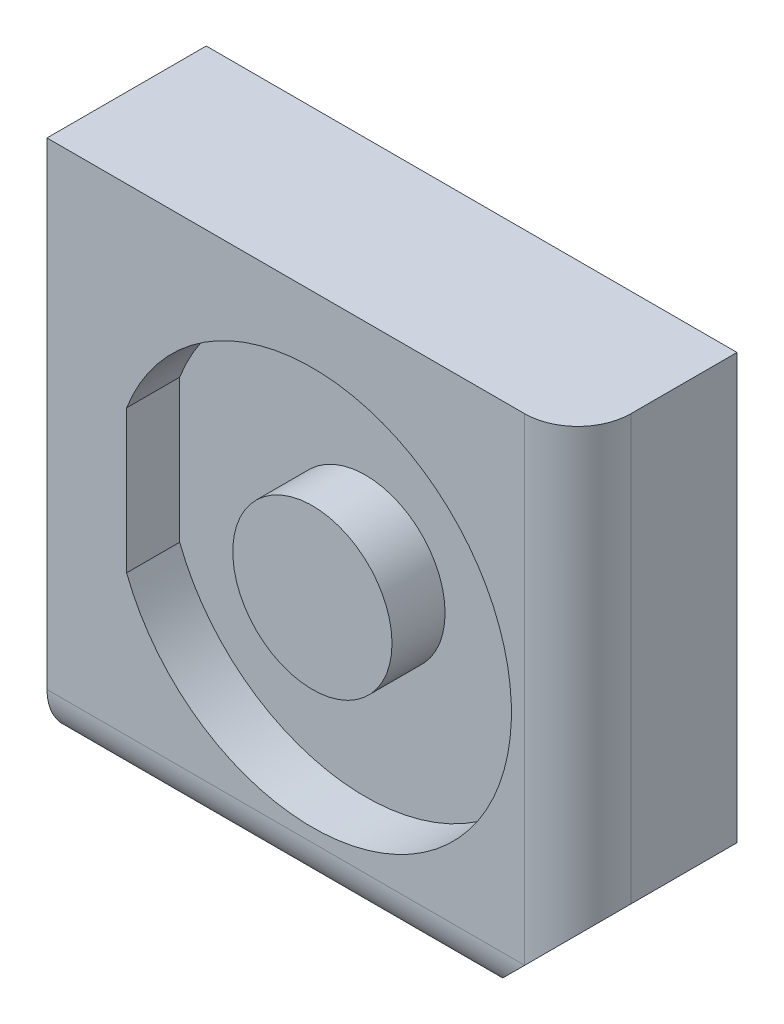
ISO-10303-21;
HEADER;
FILE_DESCRIPTION(('STEP AP214'),'2;1');
FILE_NAME('part.step','',(''),(''),'','','');
FILE_SCHEMA(('AUTOMOTIVE_DESIGN { 1 0 10303 214 1 1 1 1 }'));
ENDSEC;
DATA;
#1=APPLICATION_CONTEXT('core data for automotive mechanical design processes');
#2=APPLICATION_PROTOCOL_DEFINITION('international standard','automotive_design',2000,#1);
#3=PRODUCT_CONTEXT('',#1,'mechanical');
#4=PRODUCT('Part','Part','',(#3));
#5=PRODUCT_RELATED_PRODUCT_CATEGORY('part','',(#4));
#6=PRODUCT_DEFINITION_FORMATION('','',#4);
#7=PRODUCT_DEFINITION_CONTEXT('part definition',#1,'design');
#8=PRODUCT_DEFINITION('design','',#6,#7);
#9=PRODUCT_DEFINITION_SHAPE('','',#8);
#10=(LENGTH_UNIT() NAMED_UNIT(*) SI_UNIT(.MILLI.,.METRE.));
#11=(NAMED_UNIT(*) PLANE_ANGLE_UNIT() SI_UNIT($,.RADIAN.));
#12=(NAMED_UNIT(*) SI_UNIT($,.STERADIAN.) SOLID_ANGLE_UNIT());
#13=UNCERTAINTY_MEASURE_WITH_UNIT(LENGTH_MEASURE(1.E-05),#10,'distance_accuracy_value','');
#14=(GEOMETRIC_REPRESENTATION_CONTEXT(3) GLOBAL_UNCERTAINTY_ASSIGNED_CONTEXT((#13)) GLOBAL_UNIT_ASSIGNED_CONTEXT((#10,
#11,#12)) REPRESENTATION_CONTEXT('',''));
#15=CARTESIAN_POINT('',(0.,0.,0.));
#16=DIRECTION('',(0.,0.,1.));
#17=DIRECTION('',(1.,0.,0.));
#18=AXIS2_PLACEMENT_3D('',#15,#16,#17);
#19=CARTESIAN_POINT('',(-50.,50.,30.));
#20=DIRECTION('',(1.,0.,0.));
#21=DIRECTION('',(0.,1.,0.));
#22=AXIS2_PLACEMENT_3D('',#19,#20,#21);
#23=PLANE('',#22);
#24=DIRECTION('',(0.,0.,-1.));
#25=VECTOR('',#24,1.);
#26=CARTESIAN_POINT('',(-50.,-50.,30.));
#27=LINE('',#26,#25);
#28=CARTESIAN_POINT('',(-50.,-50.,20.));
#29=VERTEX_POINT('',#28);
#30=CARTESIAN_POINT('',(-50.,-50.,0.));
#31=VERTEX_POINT('',#30);
#32=EDGE_CURVE('E146',#29,#31,#27,.T.);
#33=ORIENTED_EDGE('',*,*,#32,.F.);
#34=CARTESIAN_POINT('',(-50.,-40.,20.));
#35=DIRECTION('',(1.,0.,0.));
#36=DIRECTION('',(0.,1.,0.));
#37=AXIS2_PLACEMENT_3D('',#34,#35,#36);
#38=CIRCLE('',#37,10.);
#39=CARTESIAN_POINT('',(-50.,-40.,30.));
#40=VERTEX_POINT('',#39);
#41=EDGE_CURVE('E155',#29,#40,#38,.F.);
#42=ORIENTED_EDGE('',*,*,#41,.T.);
#43=DIRECTION('',(0.,-1.,0.));
#44=VECTOR('',#43,1.);
#45=CARTESIAN_POINT('',(-50.,50.,30.));
#46=LINE('',#45,#44);
#47=CARTESIAN_POINT('',(-50.,50.,30.));
#48=VERTEX_POINT('',#47);
#49=EDGE_CURVE('E127',#48,#40,#46,.T.);
#50=ORIENTED_EDGE('',*,*,#49,.F.);
#51=DIRECTION('',(0.,0.,-1.));
#52=VECTOR('',#51,1.);
#53=CARTESIAN_POINT('',(-50.,50.,30.));
#54=LINE('',#53,#52);
#55=CARTESIAN_POINT('',(-50.,50.,0.));
#56=VERTEX_POINT('',#55);
#57=EDGE_CURVE('E133',#48,#56,#54,.T.);
#58=ORIENTED_EDGE('',*,*,#57,.T.);
#59=DIRECTION('',(0.,-1.,0.));
#60=VECTOR('',#59,1.);
#61=CARTESIAN_POINT('',(-50.,50.,0.));
#62=LINE('',#61,#60);
#63=EDGE_CURVE('E125',#56,#31,#62,.T.);
#64=ORIENTED_EDGE('',*,*,#63,.T.);
#65=EDGE_LOOP('',(#33,#42,#50,#58,#64));
#66=FACE_BOUND('',#65,.T.);
#67=ADVANCED_FACE('F32',(#66),#23,.F.);
#68=CARTESIAN_POINT('',(-50.,-50.,30.));
#69=DIRECTION('',(0.,1.,0.));
#70=DIRECTION('',(0.,0.,1.));
#71=AXIS2_PLACEMENT_3D('',#68,#69,#70);
#72=PLANE('',#71);
#73=DIRECTION('',(1.,0.,0.));
#74=VECTOR('',#73,1.);
#75=CARTESIAN_POINT('',(-50.,-50.,0.));
#76=LINE('',#75,#74);
#77=CARTESIAN_POINT('',(30.,-50.,0.));
#78=VERTEX_POINT('',#77);
#79=EDGE_CURVE('E136',#31,#78,#76,.T.);
#80=ORIENTED_EDGE('',*,*,#79,.T.);
#81=DIRECTION('',(0.,0.,1.));
#82=VECTOR('',#81,1.);
#83=CARTESIAN_POINT('',(30.,-50.,30.));
#84=LINE('',#83,#82);
#85=CARTESIAN_POINT('',(30.,-50.,20.));
#86=VERTEX_POINT('',#85);
#87=EDGE_CURVE('E47',#78,#86,#84,.T.);
#88=ORIENTED_EDGE('',*,*,#87,.T.);
#89=DIRECTION('',(1.,0.,0.));
#90=VECTOR('',#89,1.);
#91=CARTESIAN_POINT('',(-50.,-50.,20.));
#92=LINE('',#91,#90);
#93=EDGE_CURVE('E153',#86,#29,#92,.F.);
#94=ORIENTED_EDGE('',*,*,#93,.T.);
#95=ORIENTED_EDGE('',*,*,#32,.T.);
#96=EDGE_LOOP('',(#80,#88,#94,#95));
#97=FACE_BOUND('',#96,.T.);
#98=ADVANCED_FACE('F194',(#97),#72,.F.);
#99=CARTESIAN_POINT('',(50.,50.,30.));
#100=DIRECTION('',(-1.,0.,0.));
#101=DIRECTION('',(0.,-1.,0.));
#102=AXIS2_PLACEMENT_3D('',#99,#100,#101);
#103=PLANE('',#102);
#104=DIRECTION('',(0.,1.,0.));
#105=VECTOR('',#104,1.);
#106=CARTESIAN_POINT('',(50.,-50.,20.));
#107=LINE('',#106,#105);
#108=CARTESIAN_POINT('',(50.,50.,20.));
#109=VERTEX_POINT('',#108);
#110=CARTESIAN_POINT('',(50.,-30.,20.));
#111=VERTEX_POINT('',#110);
#112=EDGE_CURVE('E159',#109,#111,#107,.F.);
#113=ORIENTED_EDGE('',*,*,#112,.T.);
#114=DIRECTION('',(0.,0.,-1.));
#115=VECTOR('',#114,1.);
#116=CARTESIAN_POINT('',(50.,-30.,30.));
#117=LINE('',#116,#115);
#118=CARTESIAN_POINT('',(50.,-30.,0.));
#119=VERTEX_POINT('',#118);
#120=EDGE_CURVE('E162',#111,#119,#117,.T.);
#121=ORIENTED_EDGE('',*,*,#120,.T.);
#122=DIRECTION('',(0.,1.,0.));
#123=VECTOR('',#122,1.);
#124=CARTESIAN_POINT('',(50.,50.,0.));
#125=LINE('',#124,#123);
#126=CARTESIAN_POINT('',(50.,50.,0.));
#127=VERTEX_POINT('',#126);
#128=EDGE_CURVE('E138',#119,#127,#125,.T.);
#129=ORIENTED_EDGE('',*,*,#128,.T.);
#130=DIRECTION('',(0.,0.,-1.));
#131=VECTOR('',#130,1.);
#132=CARTESIAN_POINT('',(50.,50.,30.));
#133=LINE('',#132,#131);
#134=EDGE_CURVE('E143',#109,#127,#133,.T.);
#135=ORIENTED_EDGE('',*,*,#134,.F.);
#136=EDGE_LOOP('',(#113,#121,#129,#135));
#137=FACE_BOUND('',#136,.T.);
#138=ADVANCED_FACE('F184',(#137),#103,.F.);
#139=CARTESIAN_POINT('',(-50.,50.,30.));
#140=DIRECTION('',(0.,-1.,0.));
#141=DIRECTION('',(0.,0.,-1.));
#142=AXIS2_PLACEMENT_3D('',#139,#140,#141);
#143=PLANE('',#142);
#144=DIRECTION('',(-1.,0.,0.));
#145=VECTOR('',#144,1.);
#146=CARTESIAN_POINT('',(-50.,50.,30.));
#147=LINE('',#146,#145);
#148=CARTESIAN_POINT('',(40.,50.,30.));
#149=VERTEX_POINT('',#148);
#150=EDGE_CURVE('E130',#149,#48,#147,.T.);
#151=ORIENTED_EDGE('',*,*,#150,.F.);
#152=CARTESIAN_POINT('',(40.,50.,20.));
#153=DIRECTION('',(0.,-1.,0.));
#154=DIRECTION('',(0.,0.,-1.));
#155=AXIS2_PLACEMENT_3D('',#152,#153,#154);
#156=CIRCLE('',#155,10.);
#157=EDGE_CURVE('E157',#149,#109,#156,.F.);
#158=ORIENTED_EDGE('',*,*,#157,.T.);
#159=ORIENTED_EDGE('',*,*,#134,.T.);
#160=DIRECTION('',(-1.,0.,0.));
#161=VECTOR('',#160,1.);
#162=CARTESIAN_POINT('',(-50.,50.,0.));
#163=LINE('',#162,#161);
#164=EDGE_CURVE('E131',#127,#56,#163,.T.);
#165=ORIENTED_EDGE('',*,*,#164,.T.);
#166=ORIENTED_EDGE('',*,*,#57,.F.);
#167=EDGE_LOOP('',(#151,#158,#159,#165,#166));
#168=FACE_BOUND('',#167,.T.);
#169=ADVANCED_FACE('F191',(#168),#143,.F.);
#170=CARTESIAN_POINT('',(0.,0.,30.));
#171=DIRECTION('',(0.,0.,1.));
#172=DIRECTION('',(1.,0.,0.));
#173=AXIS2_PLACEMENT_3D('',#170,#171,#172);
#174=PLANE('',#173);
#175=CARTESIAN_POINT('',(0.,0.,30.));
#176=DIRECTION('',(0.,0.,1.));
#177=DIRECTION('',(1.,0.,0.));
#178=AXIS2_PLACEMENT_3D('',#175,#176,#177);
#179=CIRCLE('',#178,37.5);
#180=CARTESIAN_POINT('',(-35.,-13.4629120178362,30.));
#181=VERTEX_POINT('',#180);
#182=CARTESIAN_POINT('',(-35.,13.4629120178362,30.));
#183=VERTEX_POINT('',#182);
#184=EDGE_CURVE('E106',#181,#183,#179,.T.);
#185=ORIENTED_EDGE('',*,*,#184,.F.);
#186=DIRECTION('',(0.,-1.,0.));
#187=VECTOR('',#186,1.);
#188=CARTESIAN_POINT('',(-35.,13.4629120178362,30.));
#189=LINE('',#188,#187);
#190=EDGE_CURVE('E116',#183,#181,#189,.T.);
#191=ORIENTED_EDGE('',*,*,#190,.F.);
#192=EDGE_LOOP('',(#185,#191));
#193=FACE_BOUND('',#192,.T.);
#194=ORIENTED_EDGE('',*,*,#49,.T.);
#195=DIRECTION('',(1.,0.,0.));
#196=VECTOR('',#195,1.);
#197=CARTESIAN_POINT('',(50.,-40.,30.));
#198=LINE('',#197,#196);
#199=CARTESIAN_POINT('',(40.,-40.,30.));
#200=VERTEX_POINT('',#199);
#201=EDGE_CURVE('E150',#40,#200,#198,.T.);
#202=ORIENTED_EDGE('',*,*,#201,.T.);
#203=DIRECTION('',(0.,1.,0.));
#204=VECTOR('',#203,1.);
#205=CARTESIAN_POINT('',(40.,50.,30.));
#206=LINE('',#205,#204);
#207=EDGE_CURVE('E148',#200,#149,#206,.T.);
#208=ORIENTED_EDGE('',*,*,#207,.T.);
#209=ORIENTED_EDGE('',*,*,#150,.T.);
#210=EDGE_LOOP('',(#194,#202,#208,#209));
#211=FACE_BOUND('',#210,.T.);
#212=ADVANCED_FACE('F180',(#193,#211),#174,.T.);
#213=CARTESIAN_POINT('',(0.,0.,0.));
#214=DIRECTION('',(0.,0.,1.));
#215=DIRECTION('',(1.,0.,0.));
#216=AXIS2_PLACEMENT_3D('',#213,#214,#215);
#217=PLANE('',#216);
#218=ORIENTED_EDGE('',*,*,#128,.F.);
#219=DIRECTION('',(0.707106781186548,0.707106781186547,0.));
#220=VECTOR('',#219,1.);
#221=CARTESIAN_POINT('',(50.,-30.,0.));
#222=LINE('',#221,#220);
#223=EDGE_CURVE('E55',#119,#78,#222,.F.);
#224=ORIENTED_EDGE('',*,*,#223,.T.);
#225=ORIENTED_EDGE('',*,*,#79,.F.);
#226=ORIENTED_EDGE('',*,*,#63,.F.);
#227=ORIENTED_EDGE('',*,*,#164,.F.);
#228=EDGE_LOOP('',(#218,#224,#225,#226,#227));
#229=FACE_BOUND('',#228,.T.);
#230=ADVANCED_FACE('F187',(#229),#217,.F.);
#231=CARTESIAN_POINT('',(0.,0.,20.));
#232=DIRECTION('',(0.,0.,1.));
#233=DIRECTION('',(1.,0.,0.));
#234=AXIS2_PLACEMENT_3D('',#231,#232,#233);
#235=CYLINDRICAL_SURFACE('',#234,37.5);
#236=ORIENTED_EDGE('',*,*,#184,.T.);
#237=DIRECTION('',(0.,0.,1.));
#238=VECTOR('',#237,1.);
#239=CARTESIAN_POINT('',(-35.,13.4629120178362,20.));
#240=LINE('',#239,#238);
#241=CARTESIAN_POINT('',(-35.,13.4629120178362,20.));
#242=VERTEX_POINT('',#241);
#243=EDGE_CURVE('E100',#242,#183,#240,.T.);
#244=ORIENTED_EDGE('',*,*,#243,.F.);
#245=CARTESIAN_POINT('',(0.,0.,20.));
#246=DIRECTION('',(0.,0.,1.));
#247=DIRECTION('',(1.,0.,0.));
#248=AXIS2_PLACEMENT_3D('',#245,#246,#247);
#249=CIRCLE('',#248,37.5);
#250=CARTESIAN_POINT('',(-35.,-13.4629120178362,20.));
#251=VERTEX_POINT('',#250);
#252=EDGE_CURVE('E103',#251,#242,#249,.T.);
#253=ORIENTED_EDGE('',*,*,#252,.F.);
#254=DIRECTION('',(0.,0.,1.));
#255=VECTOR('',#254,1.);
#256=CARTESIAN_POINT('',(-35.,-13.4629120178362,20.));
#257=LINE('',#256,#255);
#258=EDGE_CURVE('E111',#251,#181,#257,.T.);
#259=ORIENTED_EDGE('',*,*,#258,.T.);
#260=EDGE_LOOP('',(#236,#244,#253,#259));
#261=FACE_BOUND('',#260,.T.);
#262=ADVANCED_FACE('F102',(#261),#235,.F.);
#263=CARTESIAN_POINT('',(-35.,13.4629120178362,20.));
#264=DIRECTION('',(-1.,0.,0.));
#265=DIRECTION('',(0.,0.,1.));
#266=AXIS2_PLACEMENT_3D('',#263,#264,#265);
#267=PLANE('',#266);
#268=ORIENTED_EDGE('',*,*,#190,.T.);
#269=ORIENTED_EDGE('',*,*,#258,.F.);
#270=DIRECTION('',(0.,-1.,0.));
#271=VECTOR('',#270,1.);
#272=CARTESIAN_POINT('',(-35.,13.4629120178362,20.));
#273=LINE('',#272,#271);
#274=EDGE_CURVE('E112',#242,#251,#273,.T.);
#275=ORIENTED_EDGE('',*,*,#274,.F.);
#276=ORIENTED_EDGE('',*,*,#243,.T.);
#277=EDGE_LOOP('',(#268,#269,#275,#276));
#278=FACE_BOUND('',#277,.T.);
#279=ADVANCED_FACE('F118',(#278),#267,.F.);
#280=CARTESIAN_POINT('',(0.,0.,20.));
#281=DIRECTION('',(0.,0.,1.));
#282=DIRECTION('',(1.,0.,0.));
#283=AXIS2_PLACEMENT_3D('',#280,#281,#282);
#284=PLANE('',#283);
#285=CARTESIAN_POINT('',(0.,0.,20.));
#286=DIRECTION('',(0.,0.,1.));
#287=DIRECTION('',(1.,0.,0.));
#288=AXIS2_PLACEMENT_3D('',#285,#286,#287);
#289=CIRCLE('',#288,15.);
#290=CARTESIAN_POINT('',(15.,0.,20.));
#291=VERTEX_POINT('',#290);
#292=EDGE_CURVE('E123',#291,#291,#289,.T.);
#293=ORIENTED_EDGE('',*,*,#292,.F.);
#294=EDGE_LOOP('',(#293));
#295=FACE_BOUND('',#294,.T.);
#296=ORIENTED_EDGE('',*,*,#252,.T.);
#297=ORIENTED_EDGE('',*,*,#274,.T.);
#298=EDGE_LOOP('',(#296,#297));
#299=FACE_BOUND('',#298,.T.);
#300=ADVANCED_FACE('F115',(#295,#299),#284,.T.);
#301=CARTESIAN_POINT('',(0.,0.,20.));
#302=DIRECTION('',(0.,0.,1.));
#303=DIRECTION('',(1.,0.,0.));
#304=AXIS2_PLACEMENT_3D('',#301,#302,#303);
#305=CYLINDRICAL_SURFACE('',#304,15.);
#306=ORIENTED_EDGE('',*,*,#292,.T.);
#307=EDGE_LOOP('',(#306));
#308=FACE_BOUND('',#307,.T.);
#309=CARTESIAN_POINT('',(0.,0.,30.));
#310=DIRECTION('',(0.,0.,1.));
#311=DIRECTION('',(1.,0.,0.));
#312=AXIS2_PLACEMENT_3D('',#309,#310,#311);
#313=CIRCLE('',#312,15.);
#314=CARTESIAN_POINT('',(15.,0.,30.));
#315=VERTEX_POINT('',#314);
#316=EDGE_CURVE('E313',#315,#315,#313,.T.);
#317=ORIENTED_EDGE('',*,*,#316,.F.);
#318=EDGE_LOOP('',(#317));
#319=FACE_BOUND('',#318,.T.);
#320=ADVANCED_FACE('F213',(#308,#319),#305,.T.);
#321=ORIENTED_EDGE('',*,*,#316,.T.);
#322=EDGE_LOOP('',(#321));
#323=FACE_BOUND('',#322,.T.);
#324=ADVANCED_FACE('F208',(#323),#174,.T.);
#325=CARTESIAN_POINT('',(40.,0.,20.));
#326=DIRECTION('',(0.,-1.,0.));
#327=DIRECTION('',(1.,0.,0.));
#328=AXIS2_PLACEMENT_3D('',#325,#326,#327);
#329=CYLINDRICAL_SURFACE('',#328,10.);
#330=ORIENTED_EDGE('',*,*,#207,.F.);
#331=CARTESIAN_POINT('',(40.,-40.,20.));
#332=DIRECTION('',(-0.707106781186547,0.707106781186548,0.));
#333=DIRECTION('',(-0.707106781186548,-0.707106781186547,0.));
#334=AXIS2_PLACEMENT_3D('',#331,#332,#333);
#335=ELLIPSE('',#334,14.1421356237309,10.);
#336=EDGE_CURVE('E11',#200,#111,#335,.T.);
#337=ORIENTED_EDGE('',*,*,#336,.T.);
#338=ORIENTED_EDGE('',*,*,#112,.F.);
#339=ORIENTED_EDGE('',*,*,#157,.F.);
#340=EDGE_LOOP('',(#330,#337,#338,#339));
#341=FACE_BOUND('',#340,.T.);
#342=ADVANCED_FACE('F176',(#341),#329,.T.);
#343=CARTESIAN_POINT('',(0.,-40.,20.));
#344=DIRECTION('',(-1.,0.,0.));
#345=DIRECTION('',(0.,0.,1.));
#346=AXIS2_PLACEMENT_3D('',#343,#344,#345);
#347=CYLINDRICAL_SURFACE('',#346,10.);
#348=ORIENTED_EDGE('',*,*,#93,.F.);
#349=CARTESIAN_POINT('',(40.,-40.,20.));
#350=DIRECTION('',(-0.707106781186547,0.707106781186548,0.));
#351=DIRECTION('',(-0.707106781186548,-0.707106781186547,0.));
#352=AXIS2_PLACEMENT_3D('',#349,#350,#351);
#353=ELLIPSE('',#352,14.142135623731,10.);
#354=EDGE_CURVE('E40',#86,#200,#353,.T.);
#355=ORIENTED_EDGE('',*,*,#354,.T.);
#356=ORIENTED_EDGE('',*,*,#201,.F.);
#357=ORIENTED_EDGE('',*,*,#41,.F.);
#358=EDGE_LOOP('',(#348,#355,#356,#357));
#359=FACE_BOUND('',#358,.T.);
#360=ADVANCED_FACE('F170',(#359),#347,.T.);
#361=CARTESIAN_POINT('',(50.,-30.,30.));
#362=DIRECTION('',(-0.707106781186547,0.707106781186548,0.));
#363=DIRECTION('',(0.,0.,-1.));
#364=AXIS2_PLACEMENT_3D('',#361,#362,#363);
#365=PLANE('',#364);
#366=ORIENTED_EDGE('',*,*,#354,.F.);
#367=ORIENTED_EDGE('',*,*,#87,.F.);
#368=ORIENTED_EDGE('',*,*,#223,.F.);
#369=ORIENTED_EDGE('',*,*,#120,.F.);
#370=ORIENTED_EDGE('',*,*,#336,.F.);
#371=EDGE_LOOP('',(#366,#367,#368,#369,#370));
#372=FACE_BOUND('',#371,.T.);
#373=ADVANCED_FACE('F34',(#372),#365,.F.);
#374=CLOSED_SHELL('',(#67,#98,#138,#169,#212,#230,#262,#279,#300,#320,#324,#342,#360,#373));
#375=MANIFOLD_SOLID_BREP('B2',#374);
#376=ADVANCED_BREP_SHAPE_REPRESENTATION('',(#18,#375),#14);
#377=SHAPE_DEFINITION_REPRESENTATION(#9,#376);
ENDSEC;
END-ISO-10303-21;
